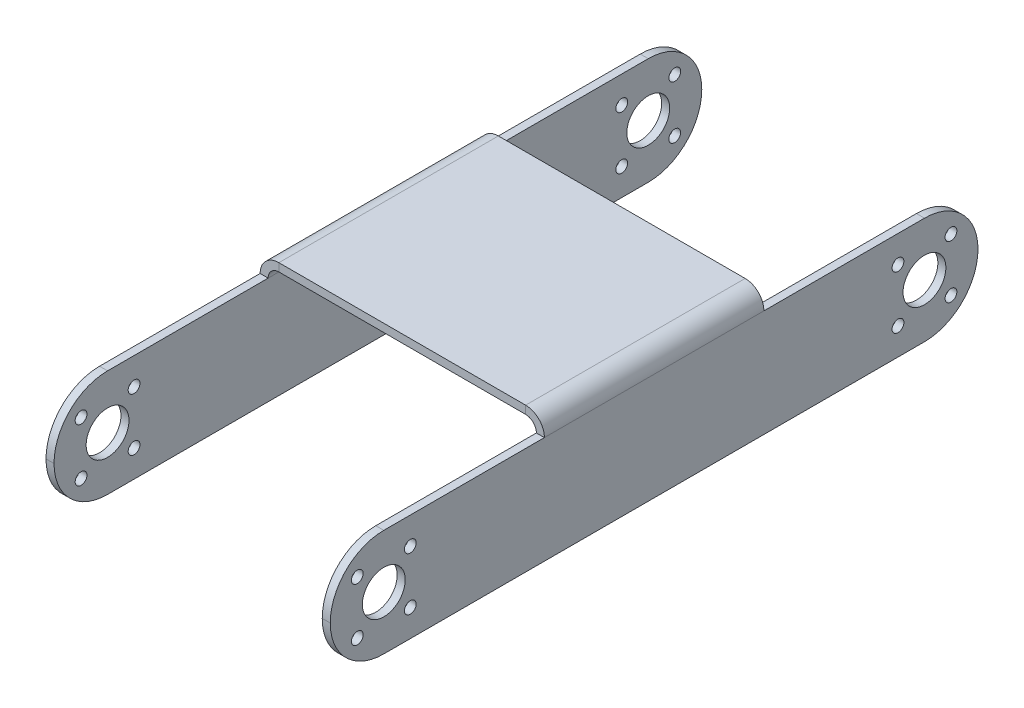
ISO-10303-21;
HEADER;
FILE_DESCRIPTION(('STEP AP214'),'2;1');
FILE_NAME('part.step','',(''),(''),'','','');
FILE_SCHEMA(('AUTOMOTIVE_DESIGN { 1 0 10303 214 1 1 1 1 }'));
ENDSEC;
DATA;
#1=APPLICATION_CONTEXT('core data for automotive mechanical design processes');
#2=APPLICATION_PROTOCOL_DEFINITION('international standard','automotive_design',2000,#1);
#3=PRODUCT_CONTEXT('',#1,'mechanical');
#4=PRODUCT('Part','Part','',(#3));
#5=PRODUCT_RELATED_PRODUCT_CATEGORY('part','',(#4));
#6=PRODUCT_DEFINITION_FORMATION('','',#4);
#7=PRODUCT_DEFINITION_CONTEXT('part definition',#1,'design');
#8=PRODUCT_DEFINITION('design','',#6,#7);
#9=PRODUCT_DEFINITION_SHAPE('','',#8);
#10=(LENGTH_UNIT() NAMED_UNIT(*) SI_UNIT(.MILLI.,.METRE.));
#11=(NAMED_UNIT(*) PLANE_ANGLE_UNIT() SI_UNIT($,.RADIAN.));
#12=(NAMED_UNIT(*) SI_UNIT($,.STERADIAN.) SOLID_ANGLE_UNIT());
#13=UNCERTAINTY_MEASURE_WITH_UNIT(LENGTH_MEASURE(1.E-05),#10,'distance_accuracy_value','');
#14=(GEOMETRIC_REPRESENTATION_CONTEXT(3) GLOBAL_UNCERTAINTY_ASSIGNED_CONTEXT((#13)) GLOBAL_UNIT_ASSIGNED_CONTEXT((#10,
#11,#12)) REPRESENTATION_CONTEXT('',''));
#15=CARTESIAN_POINT('',(0.,0.,0.));
#16=DIRECTION('',(0.,0.,1.));
#17=DIRECTION('',(1.,0.,0.));
#18=AXIS2_PLACEMENT_3D('',#15,#16,#17);
#19=CARTESIAN_POINT('',(-1.5,9.99999999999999,-60.5));
#20=DIRECTION('',(0.,1.,0.));
#21=DIRECTION('',(0.,0.,1.));
#22=AXIS2_PLACEMENT_3D('',#19,#20,#21);
#23=PLANE('',#22);
#24=DIRECTION('',(0.,0.,1.));
#25=VECTOR('',#24,1.);
#26=CARTESIAN_POINT('',(-1.5,9.99999999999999,-60.5));
#27=LINE('',#26,#25);
#28=CARTESIAN_POINT('',(-1.5,9.99999999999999,-50.5));
#29=VERTEX_POINT('',#28);
#30=CARTESIAN_POINT('',(-1.5,9.99999999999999,-20.5));
#31=VERTEX_POINT('',#30);
#32=EDGE_CURVE('E554',#29,#31,#27,.T.);
#33=ORIENTED_EDGE('',*,*,#32,.T.);
#34=DIRECTION('',(1.,0.,0.));
#35=VECTOR('',#34,1.);
#36=CARTESIAN_POINT('',(-1.5,9.99999999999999,-20.5));
#37=LINE('',#36,#35);
#38=CARTESIAN_POINT('',(0.,9.99999999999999,-20.5));
#39=VERTEX_POINT('',#38);
#40=EDGE_CURVE('E447',#31,#39,#37,.T.);
#41=ORIENTED_EDGE('',*,*,#40,.T.);
#42=DIRECTION('',(0.,0.,1.));
#43=VECTOR('',#42,1.);
#44=CARTESIAN_POINT('',(0.,9.99999999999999,-60.5));
#45=LINE('',#44,#43);
#46=CARTESIAN_POINT('',(0.,9.99999999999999,-50.5));
#47=VERTEX_POINT('',#46);
#48=EDGE_CURVE('E553',#47,#39,#45,.T.);
#49=ORIENTED_EDGE('',*,*,#48,.F.);
#50=DIRECTION('',(1.,0.,0.));
#51=VECTOR('',#50,1.);
#52=CARTESIAN_POINT('',(-1.5,9.99999999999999,-50.5));
#53=LINE('',#52,#51);
#54=EDGE_CURVE('E13',#47,#29,#53,.F.);
#55=ORIENTED_EDGE('',*,*,#54,.T.);
#56=EDGE_LOOP('',(#33,#41,#49,#55));
#57=FACE_BOUND('',#56,.T.);
#58=ADVANCED_FACE('F67',(#57),#23,.T.);
#59=DIRECTION('',(1.,0.,0.));
#60=VECTOR('',#59,1.);
#61=CARTESIAN_POINT('',(-1.5,9.99999999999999,20.5));
#62=LINE('',#61,#60);
#63=CARTESIAN_POINT('',(-1.5,9.99999999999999,20.5));
#64=VERTEX_POINT('',#63);
#65=CARTESIAN_POINT('',(0.,9.99999999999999,20.5));
#66=VERTEX_POINT('',#65);
#67=EDGE_CURVE('E460',#64,#66,#62,.T.);
#68=ORIENTED_EDGE('',*,*,#67,.F.);
#69=CARTESIAN_POINT('',(-1.5,9.99999999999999,50.5));
#70=VERTEX_POINT('',#69);
#71=EDGE_CURVE('E552',#64,#70,#27,.T.);
#72=ORIENTED_EDGE('',*,*,#71,.T.);
#73=DIRECTION('',(1.,0.,0.));
#74=VECTOR('',#73,1.);
#75=CARTESIAN_POINT('',(-1.5,9.99999999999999,50.5));
#76=LINE('',#75,#74);
#77=CARTESIAN_POINT('',(0.,9.99999999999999,50.5));
#78=VERTEX_POINT('',#77);
#79=EDGE_CURVE('E77',#70,#78,#76,.T.);
#80=ORIENTED_EDGE('',*,*,#79,.T.);
#81=EDGE_CURVE('E562',#66,#78,#45,.T.);
#82=ORIENTED_EDGE('',*,*,#81,.F.);
#83=EDGE_LOOP('',(#68,#72,#80,#82));
#84=FACE_BOUND('',#83,.T.);
#85=ADVANCED_FACE('F642',(#84),#23,.T.);
#86=CARTESIAN_POINT('',(-1.5,-9.99999999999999,-60.5));
#87=DIRECTION('',(0.,-1.,0.));
#88=DIRECTION('',(0.,0.,-1.));
#89=AXIS2_PLACEMENT_3D('',#86,#87,#88);
#90=PLANE('',#89);
#91=DIRECTION('',(0.,0.,-1.));
#92=VECTOR('',#91,1.);
#93=CARTESIAN_POINT('',(-1.5,-9.99999999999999,-60.5));
#94=LINE('',#93,#92);
#95=CARTESIAN_POINT('',(-1.5,-9.99999999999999,50.5));
#96=VERTEX_POINT('',#95);
#97=CARTESIAN_POINT('',(-1.5,-9.99999999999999,-50.5));
#98=VERTEX_POINT('',#97);
#99=EDGE_CURVE('E548',#96,#98,#94,.T.);
#100=ORIENTED_EDGE('',*,*,#99,.T.);
#101=DIRECTION('',(1.,0.,0.));
#102=VECTOR('',#101,1.);
#103=CARTESIAN_POINT('',(-1.5,-9.99999999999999,-50.5));
#104=LINE('',#103,#102);
#105=CARTESIAN_POINT('',(0.,-9.99999999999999,-50.5));
#106=VERTEX_POINT('',#105);
#107=EDGE_CURVE('E569',#98,#106,#104,.T.);
#108=ORIENTED_EDGE('',*,*,#107,.T.);
#109=DIRECTION('',(0.,0.,-1.));
#110=VECTOR('',#109,1.);
#111=CARTESIAN_POINT('',(0.,-9.99999999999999,-60.5));
#112=LINE('',#111,#110);
#113=CARTESIAN_POINT('',(0.,-9.99999999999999,50.5));
#114=VERTEX_POINT('',#113);
#115=EDGE_CURVE('E544',#114,#106,#112,.T.);
#116=ORIENTED_EDGE('',*,*,#115,.F.);
#117=DIRECTION('',(1.,0.,0.));
#118=VECTOR('',#117,1.);
#119=CARTESIAN_POINT('',(-1.5,-9.99999999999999,50.5));
#120=LINE('',#119,#118);
#121=EDGE_CURVE('E558',#114,#96,#120,.F.);
#122=ORIENTED_EDGE('',*,*,#121,.T.);
#123=EDGE_LOOP('',(#100,#108,#116,#122));
#124=FACE_BOUND('',#123,.T.);
#125=ADVANCED_FACE('F620',(#124),#90,.T.);
#126=CARTESIAN_POINT('',(-1.5,0.,0.));
#127=DIRECTION('',(1.,0.,0.));
#128=DIRECTION('',(0.,0.,-1.));
#129=AXIS2_PLACEMENT_3D('',#126,#127,#128);
#130=PLANE('',#129);
#131=CARTESIAN_POINT('',(-1.5,-4.94974746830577,-55.4497474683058));
#132=DIRECTION('',(1.,0.,0.));
#133=DIRECTION('',(0.,0.,1.));
#134=AXIS2_PLACEMENT_3D('',#131,#132,#133);
#135=CIRCLE('',#134,1.1);
#136=CARTESIAN_POINT('',(-1.5,-4.94974746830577,-54.3497474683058));
#137=VERTEX_POINT('',#136);
#138=EDGE_CURVE('E470',#137,#137,#135,.T.);
#139=ORIENTED_EDGE('',*,*,#138,.T.);
#140=EDGE_LOOP('',(#139));
#141=FACE_BOUND('',#140,.T.);
#142=CARTESIAN_POINT('',(-1.5,-4.94974746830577,55.4497474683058));
#143=DIRECTION('',(1.,0.,0.));
#144=DIRECTION('',(0.,0.,-1.));
#145=AXIS2_PLACEMENT_3D('',#142,#143,#144);
#146=CIRCLE('',#145,1.1);
#147=CARTESIAN_POINT('',(-1.5,-4.94974746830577,54.3497474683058));
#148=VERTEX_POINT('',#147);
#149=EDGE_CURVE('E497',#148,#148,#146,.T.);
#150=ORIENTED_EDGE('',*,*,#149,.T.);
#151=EDGE_LOOP('',(#150));
#152=FACE_BOUND('',#151,.T.);
#153=CARTESIAN_POINT('',(-1.5,-4.94974746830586,45.5502525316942));
#154=DIRECTION('',(1.,0.,0.));
#155=DIRECTION('',(0.,0.,-1.));
#156=AXIS2_PLACEMENT_3D('',#153,#154,#155);
#157=CIRCLE('',#156,1.09999999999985);
#158=CARTESIAN_POINT('',(-1.5,-4.94974746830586,44.4502525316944));
#159=VERTEX_POINT('',#158);
#160=EDGE_CURVE('E496',#159,#159,#157,.T.);
#161=ORIENTED_EDGE('',*,*,#160,.T.);
#162=EDGE_LOOP('',(#161));
#163=FACE_BOUND('',#162,.T.);
#164=CARTESIAN_POINT('',(-1.5,4.94974746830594,45.5502525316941));
#165=DIRECTION('',(1.,0.,0.));
#166=DIRECTION('',(0.,0.,-1.));
#167=AXIS2_PLACEMENT_3D('',#164,#165,#166);
#168=CIRCLE('',#167,1.1);
#169=CARTESIAN_POINT('',(-1.5,4.94974746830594,44.4502525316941));
#170=VERTEX_POINT('',#169);
#171=EDGE_CURVE('E513',#170,#170,#168,.T.);
#172=ORIENTED_EDGE('',*,*,#171,.T.);
#173=EDGE_LOOP('',(#172));
#174=FACE_BOUND('',#173,.T.);
#175=CARTESIAN_POINT('',(-1.5,-4.94974746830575,-45.5502525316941));
#176=DIRECTION('',(1.,0.,0.));
#177=DIRECTION('',(0.,0.,1.));
#178=AXIS2_PLACEMENT_3D('',#175,#176,#177);
#179=CIRCLE('',#178,1.1);
#180=CARTESIAN_POINT('',(-1.5,-4.94974746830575,-44.4502525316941));
#181=VERTEX_POINT('',#180);
#182=EDGE_CURVE('E471',#181,#181,#179,.T.);
#183=ORIENTED_EDGE('',*,*,#182,.T.);
#184=EDGE_LOOP('',(#183));
#185=FACE_BOUND('',#184,.T.);
#186=CARTESIAN_POINT('',(-1.5,4.94974746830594,-45.5502525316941));
#187=DIRECTION('',(1.,0.,0.));
#188=DIRECTION('',(0.,0.,1.));
#189=AXIS2_PLACEMENT_3D('',#186,#187,#188);
#190=CIRCLE('',#189,1.1);
#191=CARTESIAN_POINT('',(-1.5,4.94974746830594,-44.4502525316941));
#192=VERTEX_POINT('',#191);
#193=EDGE_CURVE('E479',#192,#192,#190,.T.);
#194=ORIENTED_EDGE('',*,*,#193,.T.);
#195=EDGE_LOOP('',(#194));
#196=FACE_BOUND('',#195,.T.);
#197=CARTESIAN_POINT('',(-1.5,4.94974746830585,-55.4497474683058));
#198=DIRECTION('',(1.,0.,0.));
#199=DIRECTION('',(0.,0.,1.));
#200=AXIS2_PLACEMENT_3D('',#197,#198,#199);
#201=CIRCLE('',#200,1.1);
#202=CARTESIAN_POINT('',(-1.5,4.94974746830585,-54.3497474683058));
#203=VERTEX_POINT('',#202);
#204=EDGE_CURVE('E487',#203,#203,#201,.T.);
#205=ORIENTED_EDGE('',*,*,#204,.T.);
#206=EDGE_LOOP('',(#205));
#207=FACE_BOUND('',#206,.T.);
#208=CARTESIAN_POINT('',(-1.5,4.94974746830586,55.4497474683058));
#209=DIRECTION('',(1.,0.,0.));
#210=DIRECTION('',(0.,0.,-1.));
#211=AXIS2_PLACEMENT_3D('',#208,#209,#210);
#212=CIRCLE('',#211,1.09999999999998);
#213=CARTESIAN_POINT('',(-1.5,4.94974746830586,54.3497474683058));
#214=VERTEX_POINT('',#213);
#215=EDGE_CURVE('E524',#214,#214,#212,.T.);
#216=ORIENTED_EDGE('',*,*,#215,.T.);
#217=EDGE_LOOP('',(#216));
#218=FACE_BOUND('',#217,.T.);
#219=CARTESIAN_POINT('',(-1.5,0.,-50.5));
#220=DIRECTION('',(1.,0.,0.));
#221=DIRECTION('',(0.,0.,1.));
#222=AXIS2_PLACEMENT_3D('',#219,#220,#221);
#223=CIRCLE('',#222,4.00000000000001);
#224=CARTESIAN_POINT('',(-1.5,0.,-46.5));
#225=VERTEX_POINT('',#224);
#226=EDGE_CURVE('E532',#225,#225,#223,.T.);
#227=ORIENTED_EDGE('',*,*,#226,.T.);
#228=EDGE_LOOP('',(#227));
#229=FACE_BOUND('',#228,.T.);
#230=CARTESIAN_POINT('',(-1.5,0.,50.5));
#231=DIRECTION('',(1.,0.,0.));
#232=DIRECTION('',(0.,0.,-1.));
#233=AXIS2_PLACEMENT_3D('',#230,#231,#232);
#234=CIRCLE('',#233,4.00000000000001);
#235=CARTESIAN_POINT('',(-1.5,0.,46.5));
#236=VERTEX_POINT('',#235);
#237=EDGE_CURVE('E540',#236,#236,#234,.T.);
#238=ORIENTED_EDGE('',*,*,#237,.T.);
#239=EDGE_LOOP('',(#238));
#240=FACE_BOUND('',#239,.T.);
#241=CARTESIAN_POINT('',(-1.5,0.,-50.5));
#242=DIRECTION('',(1.,0.,0.));
#243=DIRECTION('',(0.,0.,-1.));
#244=AXIS2_PLACEMENT_3D('',#241,#242,#243);
#245=CIRCLE('',#244,10.);
#246=CARTESIAN_POINT('',(-1.5,0.,-60.5));
#247=VERTEX_POINT('',#246);
#248=EDGE_CURVE('E93',#29,#247,#245,.F.);
#249=ORIENTED_EDGE('',*,*,#248,.T.);
#250=CARTESIAN_POINT('',(-1.5,0.,-50.5));
#251=DIRECTION('',(1.,0.,0.));
#252=DIRECTION('',(0.,0.,-1.));
#253=AXIS2_PLACEMENT_3D('',#250,#251,#252);
#254=CIRCLE('',#253,10.);
#255=EDGE_CURVE('E594',#247,#98,#254,.F.);
#256=ORIENTED_EDGE('',*,*,#255,.T.);
#257=ORIENTED_EDGE('',*,*,#99,.F.);
#258=CARTESIAN_POINT('',(-1.5,0.,50.5));
#259=DIRECTION('',(1.,0.,0.));
#260=DIRECTION('',(0.,0.,-1.));
#261=AXIS2_PLACEMENT_3D('',#258,#259,#260);
#262=CIRCLE('',#261,10.);
#263=CARTESIAN_POINT('',(-1.5,0.,60.5));
#264=VERTEX_POINT('',#263);
#265=EDGE_CURVE('E589',#96,#264,#262,.F.);
#266=ORIENTED_EDGE('',*,*,#265,.T.);
#267=CARTESIAN_POINT('',(-1.5,0.,50.5));
#268=DIRECTION('',(1.,0.,0.));
#269=DIRECTION('',(0.,0.,-1.));
#270=AXIS2_PLACEMENT_3D('',#267,#268,#269);
#271=CIRCLE('',#270,10.);
#272=EDGE_CURVE('E585',#264,#70,#271,.F.);
#273=ORIENTED_EDGE('',*,*,#272,.T.);
#274=ORIENTED_EDGE('',*,*,#71,.F.);
#275=DIRECTION('',(0.,0.,-1.));
#276=VECTOR('',#275,1.);
#277=CARTESIAN_POINT('',(-1.5,9.99999999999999,-20.5));
#278=LINE('',#277,#276);
#279=EDGE_CURVE('E454',#31,#64,#278,.F.);
#280=ORIENTED_EDGE('',*,*,#279,.F.);
#281=ORIENTED_EDGE('',*,*,#32,.F.);
#282=EDGE_LOOP('',(#249,#256,#257,#266,#273,#274,#280,#281));
#283=FACE_BOUND('',#282,.T.);
#284=ADVANCED_FACE('F615',(#141,#152,#163,#174,#185,#196,#207,#218,#229,#240,#283),#130,.F.);
#285=CARTESIAN_POINT('',(0.,0.,0.));
#286=DIRECTION('',(1.,0.,0.));
#287=DIRECTION('',(0.,0.,-1.));
#288=AXIS2_PLACEMENT_3D('',#285,#286,#287);
#289=PLANE('',#288);
#290=CARTESIAN_POINT('',(0.,-4.94974746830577,-55.4497474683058));
#291=DIRECTION('',(1.,0.,0.));
#292=DIRECTION('',(0.,0.,1.));
#293=AXIS2_PLACEMENT_3D('',#290,#291,#292);
#294=CIRCLE('',#293,1.1);
#295=CARTESIAN_POINT('',(0.,-4.94974746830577,-54.3497474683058));
#296=VERTEX_POINT('',#295);
#297=EDGE_CURVE('E501',#296,#296,#294,.T.);
#298=ORIENTED_EDGE('',*,*,#297,.F.);
#299=EDGE_LOOP('',(#298));
#300=FACE_BOUND('',#299,.T.);
#301=CARTESIAN_POINT('',(0.,-4.94974746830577,55.4497474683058));
#302=DIRECTION('',(1.,0.,0.));
#303=DIRECTION('',(0.,0.,-1.));
#304=AXIS2_PLACEMENT_3D('',#301,#302,#303);
#305=CIRCLE('',#304,1.1);
#306=CARTESIAN_POINT('',(0.,-4.94974746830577,54.3497474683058));
#307=VERTEX_POINT('',#306);
#308=EDGE_CURVE('E492',#307,#307,#305,.T.);
#309=ORIENTED_EDGE('',*,*,#308,.F.);
#310=EDGE_LOOP('',(#309));
#311=FACE_BOUND('',#310,.T.);
#312=CARTESIAN_POINT('',(0.,-4.94974746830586,45.5502525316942));
#313=DIRECTION('',(1.,0.,0.));
#314=DIRECTION('',(0.,0.,-1.));
#315=AXIS2_PLACEMENT_3D('',#312,#313,#314);
#316=CIRCLE('',#315,1.09999999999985);
#317=CARTESIAN_POINT('',(0.,-4.94974746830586,44.4502525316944));
#318=VERTEX_POINT('',#317);
#319=EDGE_CURVE('E517',#318,#318,#316,.T.);
#320=ORIENTED_EDGE('',*,*,#319,.F.);
#321=EDGE_LOOP('',(#320));
#322=FACE_BOUND('',#321,.T.);
#323=CARTESIAN_POINT('',(0.,4.94974746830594,45.5502525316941));
#324=DIRECTION('',(1.,0.,0.));
#325=DIRECTION('',(0.,0.,-1.));
#326=AXIS2_PLACEMENT_3D('',#323,#324,#325);
#327=CIRCLE('',#326,1.1);
#328=CARTESIAN_POINT('',(0.,4.94974746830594,44.4502525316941));
#329=VERTEX_POINT('',#328);
#330=EDGE_CURVE('E508',#329,#329,#327,.T.);
#331=ORIENTED_EDGE('',*,*,#330,.F.);
#332=EDGE_LOOP('',(#331));
#333=FACE_BOUND('',#332,.T.);
#334=CARTESIAN_POINT('',(0.,-4.94974746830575,-45.5502525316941));
#335=DIRECTION('',(1.,0.,0.));
#336=DIRECTION('',(0.,0.,1.));
#337=AXIS2_PLACEMENT_3D('',#334,#335,#336);
#338=CIRCLE('',#337,1.1);
#339=CARTESIAN_POINT('',(0.,-4.94974746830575,-44.4502525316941));
#340=VERTEX_POINT('',#339);
#341=EDGE_CURVE('E466',#340,#340,#338,.T.);
#342=ORIENTED_EDGE('',*,*,#341,.F.);
#343=EDGE_LOOP('',(#342));
#344=FACE_BOUND('',#343,.T.);
#345=CARTESIAN_POINT('',(0.,4.94974746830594,-45.5502525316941));
#346=DIRECTION('',(1.,0.,0.));
#347=DIRECTION('',(0.,0.,1.));
#348=AXIS2_PLACEMENT_3D('',#345,#346,#347);
#349=CIRCLE('',#348,1.1);
#350=CARTESIAN_POINT('',(0.,4.94974746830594,-44.4502525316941));
#351=VERTEX_POINT('',#350);
#352=EDGE_CURVE('E475',#351,#351,#349,.T.);
#353=ORIENTED_EDGE('',*,*,#352,.F.);
#354=EDGE_LOOP('',(#353));
#355=FACE_BOUND('',#354,.T.);
#356=CARTESIAN_POINT('',(0.,4.94974746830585,-55.4497474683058));
#357=DIRECTION('',(1.,0.,0.));
#358=DIRECTION('',(0.,0.,1.));
#359=AXIS2_PLACEMENT_3D('',#356,#357,#358);
#360=CIRCLE('',#359,1.1);
#361=CARTESIAN_POINT('',(0.,4.94974746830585,-54.3497474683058));
#362=VERTEX_POINT('',#361);
#363=EDGE_CURVE('E483',#362,#362,#360,.T.);
#364=ORIENTED_EDGE('',*,*,#363,.F.);
#365=EDGE_LOOP('',(#364));
#366=FACE_BOUND('',#365,.T.);
#367=CARTESIAN_POINT('',(0.,4.94974746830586,55.4497474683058));
#368=DIRECTION('',(1.,0.,0.));
#369=DIRECTION('',(0.,0.,-1.));
#370=AXIS2_PLACEMENT_3D('',#367,#368,#369);
#371=CIRCLE('',#370,1.09999999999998);
#372=CARTESIAN_POINT('',(0.,4.94974746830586,54.3497474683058));
#373=VERTEX_POINT('',#372);
#374=EDGE_CURVE('E512',#373,#373,#371,.T.);
#375=ORIENTED_EDGE('',*,*,#374,.F.);
#376=EDGE_LOOP('',(#375));
#377=FACE_BOUND('',#376,.T.);
#378=CARTESIAN_POINT('',(0.,0.,-50.5));
#379=DIRECTION('',(1.,0.,0.));
#380=DIRECTION('',(0.,0.,1.));
#381=AXIS2_PLACEMENT_3D('',#378,#379,#380);
#382=CIRCLE('',#381,4.00000000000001);
#383=CARTESIAN_POINT('',(0.,0.,-46.5));
#384=VERTEX_POINT('',#383);
#385=EDGE_CURVE('E528',#384,#384,#382,.T.);
#386=ORIENTED_EDGE('',*,*,#385,.F.);
#387=EDGE_LOOP('',(#386));
#388=FACE_BOUND('',#387,.T.);
#389=CARTESIAN_POINT('',(0.,0.,50.5));
#390=DIRECTION('',(1.,0.,0.));
#391=DIRECTION('',(0.,0.,-1.));
#392=AXIS2_PLACEMENT_3D('',#389,#390,#391);
#393=CIRCLE('',#392,4.00000000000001);
#394=CARTESIAN_POINT('',(0.,0.,46.5));
#395=VERTEX_POINT('',#394);
#396=EDGE_CURVE('E536',#395,#395,#393,.T.);
#397=ORIENTED_EDGE('',*,*,#396,.F.);
#398=EDGE_LOOP('',(#397));
#399=FACE_BOUND('',#398,.T.);
#400=ORIENTED_EDGE('',*,*,#115,.T.);
#401=CARTESIAN_POINT('',(0.,0.,-50.5));
#402=DIRECTION('',(1.,0.,0.));
#403=DIRECTION('',(0.,0.,-1.));
#404=AXIS2_PLACEMENT_3D('',#401,#402,#403);
#405=CIRCLE('',#404,10.);
#406=CARTESIAN_POINT('',(0.,0.,-60.5));
#407=VERTEX_POINT('',#406);
#408=EDGE_CURVE('E582',#106,#407,#405,.T.);
#409=ORIENTED_EDGE('',*,*,#408,.T.);
#410=CARTESIAN_POINT('',(0.,0.,-50.5));
#411=DIRECTION('',(1.,0.,0.));
#412=DIRECTION('',(0.,0.,-1.));
#413=AXIS2_PLACEMENT_3D('',#410,#411,#412);
#414=CIRCLE('',#413,10.);
#415=EDGE_CURVE('E579',#407,#47,#414,.T.);
#416=ORIENTED_EDGE('',*,*,#415,.T.);
#417=ORIENTED_EDGE('',*,*,#48,.T.);
#418=DIRECTION('',(0.,0.,-1.));
#419=VECTOR('',#418,1.);
#420=CARTESIAN_POINT('',(0.,9.99999999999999,-20.5));
#421=LINE('',#420,#419);
#422=EDGE_CURVE('E439',#39,#66,#421,.F.);
#423=ORIENTED_EDGE('',*,*,#422,.T.);
#424=ORIENTED_EDGE('',*,*,#81,.T.);
#425=CARTESIAN_POINT('',(0.,0.,50.5));
#426=DIRECTION('',(1.,0.,0.));
#427=DIRECTION('',(0.,0.,-1.));
#428=AXIS2_PLACEMENT_3D('',#425,#426,#427);
#429=CIRCLE('',#428,10.);
#430=CARTESIAN_POINT('',(0.,0.,60.5));
#431=VERTEX_POINT('',#430);
#432=EDGE_CURVE('E573',#78,#431,#429,.T.);
#433=ORIENTED_EDGE('',*,*,#432,.T.);
#434=CARTESIAN_POINT('',(0.,0.,50.5));
#435=DIRECTION('',(1.,0.,0.));
#436=DIRECTION('',(0.,0.,-1.));
#437=AXIS2_PLACEMENT_3D('',#434,#435,#436);
#438=CIRCLE('',#437,10.);
#439=EDGE_CURVE('E576',#431,#114,#438,.T.);
#440=ORIENTED_EDGE('',*,*,#439,.T.);
#441=EDGE_LOOP('',(#400,#409,#416,#417,#423,#424,#433,#440));
#442=FACE_BOUND('',#441,.T.);
#443=ADVANCED_FACE('F625',(#300,#311,#322,#333,#344,#355,#366,#377,#388,#399,#442),#289,.T.);
#444=CARTESIAN_POINT('',(-1.5,0.,50.5));
#445=DIRECTION('',(1.,0.,0.));
#446=DIRECTION('',(0.,0.,-1.));
#447=AXIS2_PLACEMENT_3D('',#444,#445,#446);
#448=CYLINDRICAL_SURFACE('',#447,4.00000000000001);
#449=ORIENTED_EDGE('',*,*,#237,.F.);
#450=EDGE_LOOP('',(#449));
#451=FACE_BOUND('',#450,.T.);
#452=ORIENTED_EDGE('',*,*,#396,.T.);
#453=EDGE_LOOP('',(#452));
#454=FACE_BOUND('',#453,.T.);
#455=ADVANCED_FACE('F796',(#451,#454),#448,.F.);
#456=CARTESIAN_POINT('',(-1.5,0.,-50.5));
#457=DIRECTION('',(1.,0.,0.));
#458=DIRECTION('',(0.,0.,-1.));
#459=AXIS2_PLACEMENT_3D('',#456,#457,#458);
#460=CYLINDRICAL_SURFACE('',#459,4.00000000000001);
#461=ORIENTED_EDGE('',*,*,#226,.F.);
#462=EDGE_LOOP('',(#461));
#463=FACE_BOUND('',#462,.T.);
#464=ORIENTED_EDGE('',*,*,#385,.T.);
#465=EDGE_LOOP('',(#464));
#466=FACE_BOUND('',#465,.T.);
#467=ADVANCED_FACE('F785',(#463,#466),#460,.F.);
#468=CARTESIAN_POINT('',(-1.5,4.94974746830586,55.4497474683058));
#469=DIRECTION('',(1.,0.,0.));
#470=DIRECTION('',(0.,0.,-1.));
#471=AXIS2_PLACEMENT_3D('',#468,#469,#470);
#472=CYLINDRICAL_SURFACE('',#471,1.09999999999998);
#473=ORIENTED_EDGE('',*,*,#215,.F.);
#474=EDGE_LOOP('',(#473));
#475=FACE_BOUND('',#474,.T.);
#476=ORIENTED_EDGE('',*,*,#374,.T.);
#477=EDGE_LOOP('',(#476));
#478=FACE_BOUND('',#477,.T.);
#479=ADVANCED_FACE('F774',(#475,#478),#472,.F.);
#480=CARTESIAN_POINT('',(-1.5,4.94974746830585,-55.4497474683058));
#481=DIRECTION('',(1.,0.,0.));
#482=DIRECTION('',(0.,0.,-1.));
#483=AXIS2_PLACEMENT_3D('',#480,#481,#482);
#484=CYLINDRICAL_SURFACE('',#483,1.1);
#485=ORIENTED_EDGE('',*,*,#204,.F.);
#486=EDGE_LOOP('',(#485));
#487=FACE_BOUND('',#486,.T.);
#488=ORIENTED_EDGE('',*,*,#363,.T.);
#489=EDGE_LOOP('',(#488));
#490=FACE_BOUND('',#489,.T.);
#491=ADVANCED_FACE('F763',(#487,#490),#484,.F.);
#492=CARTESIAN_POINT('',(-1.5,4.94974746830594,-45.5502525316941));
#493=DIRECTION('',(1.,0.,0.));
#494=DIRECTION('',(0.,0.,-1.));
#495=AXIS2_PLACEMENT_3D('',#492,#493,#494);
#496=CYLINDRICAL_SURFACE('',#495,1.1);
#497=ORIENTED_EDGE('',*,*,#193,.F.);
#498=EDGE_LOOP('',(#497));
#499=FACE_BOUND('',#498,.T.);
#500=ORIENTED_EDGE('',*,*,#352,.T.);
#501=EDGE_LOOP('',(#500));
#502=FACE_BOUND('',#501,.T.);
#503=ADVANCED_FACE('F752',(#499,#502),#496,.F.);
#504=CARTESIAN_POINT('',(-1.5,-4.94974746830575,-45.5502525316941));
#505=DIRECTION('',(1.,0.,0.));
#506=DIRECTION('',(0.,0.,-1.));
#507=AXIS2_PLACEMENT_3D('',#504,#505,#506);
#508=CYLINDRICAL_SURFACE('',#507,1.1);
#509=ORIENTED_EDGE('',*,*,#182,.F.);
#510=EDGE_LOOP('',(#509));
#511=FACE_BOUND('',#510,.T.);
#512=ORIENTED_EDGE('',*,*,#341,.T.);
#513=EDGE_LOOP('',(#512));
#514=FACE_BOUND('',#513,.T.);
#515=ADVANCED_FACE('F741',(#511,#514),#508,.F.);
#516=CARTESIAN_POINT('',(-1.5,4.94974746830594,45.5502525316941));
#517=DIRECTION('',(1.,0.,0.));
#518=DIRECTION('',(0.,0.,-1.));
#519=AXIS2_PLACEMENT_3D('',#516,#517,#518);
#520=CYLINDRICAL_SURFACE('',#519,1.1);
#521=ORIENTED_EDGE('',*,*,#171,.F.);
#522=EDGE_LOOP('',(#521));
#523=FACE_BOUND('',#522,.T.);
#524=ORIENTED_EDGE('',*,*,#330,.T.);
#525=EDGE_LOOP('',(#524));
#526=FACE_BOUND('',#525,.T.);
#527=ADVANCED_FACE('F730',(#523,#526),#520,.F.);
#528=CARTESIAN_POINT('',(-1.5,-4.94974746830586,45.5502525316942));
#529=DIRECTION('',(1.,0.,0.));
#530=DIRECTION('',(0.,0.,-1.));
#531=AXIS2_PLACEMENT_3D('',#528,#529,#530);
#532=CYLINDRICAL_SURFACE('',#531,1.09999999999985);
#533=ORIENTED_EDGE('',*,*,#160,.F.);
#534=EDGE_LOOP('',(#533));
#535=FACE_BOUND('',#534,.T.);
#536=ORIENTED_EDGE('',*,*,#319,.T.);
#537=EDGE_LOOP('',(#536));
#538=FACE_BOUND('',#537,.T.);
#539=ADVANCED_FACE('F719',(#535,#538),#532,.F.);
#540=CARTESIAN_POINT('',(-1.5,-4.94974746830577,55.4497474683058));
#541=DIRECTION('',(1.,0.,0.));
#542=DIRECTION('',(0.,0.,-1.));
#543=AXIS2_PLACEMENT_3D('',#540,#541,#542);
#544=CYLINDRICAL_SURFACE('',#543,1.1);
#545=ORIENTED_EDGE('',*,*,#149,.F.);
#546=EDGE_LOOP('',(#545));
#547=FACE_BOUND('',#546,.T.);
#548=ORIENTED_EDGE('',*,*,#308,.T.);
#549=EDGE_LOOP('',(#548));
#550=FACE_BOUND('',#549,.T.);
#551=ADVANCED_FACE('F708',(#547,#550),#544,.F.);
#552=CARTESIAN_POINT('',(-1.5,-4.94974746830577,-55.4497474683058));
#553=DIRECTION('',(1.,0.,0.));
#554=DIRECTION('',(0.,0.,-1.));
#555=AXIS2_PLACEMENT_3D('',#552,#553,#554);
#556=CYLINDRICAL_SURFACE('',#555,1.1);
#557=ORIENTED_EDGE('',*,*,#138,.F.);
#558=EDGE_LOOP('',(#557));
#559=FACE_BOUND('',#558,.T.);
#560=ORIENTED_EDGE('',*,*,#297,.T.);
#561=EDGE_LOOP('',(#560));
#562=FACE_BOUND('',#561,.T.);
#563=ADVANCED_FACE('F687',(#559,#562),#556,.F.);
#564=CARTESIAN_POINT('',(-1.5,0.,-50.5));
#565=DIRECTION('',(1.,0.,0.));
#566=DIRECTION('',(0.,0.,-1.));
#567=AXIS2_PLACEMENT_3D('',#564,#565,#566);
#568=CYLINDRICAL_SURFACE('',#567,10.);
#569=DIRECTION('',(1.,0.,0.));
#570=VECTOR('',#569,1.);
#571=CARTESIAN_POINT('',(-1.5,0.,-60.5));
#572=LINE('',#571,#570);
#573=EDGE_CURVE('E491',#247,#407,#572,.T.);
#574=ORIENTED_EDGE('',*,*,#573,.F.);
#575=ORIENTED_EDGE('',*,*,#248,.F.);
#576=ORIENTED_EDGE('',*,*,#54,.F.);
#577=ORIENTED_EDGE('',*,*,#415,.F.);
#578=EDGE_LOOP('',(#574,#575,#576,#577));
#579=FACE_BOUND('',#578,.T.);
#580=ADVANCED_FACE('F629',(#579),#568,.T.);
#581=CARTESIAN_POINT('',(-1.5,0.,-50.5));
#582=DIRECTION('',(1.,0.,0.));
#583=DIRECTION('',(0.,0.,-1.));
#584=AXIS2_PLACEMENT_3D('',#581,#582,#583);
#585=CYLINDRICAL_SURFACE('',#584,10.);
#586=ORIENTED_EDGE('',*,*,#255,.F.);
#587=ORIENTED_EDGE('',*,*,#573,.T.);
#588=ORIENTED_EDGE('',*,*,#408,.F.);
#589=ORIENTED_EDGE('',*,*,#107,.F.);
#590=EDGE_LOOP('',(#586,#587,#588,#589));
#591=FACE_BOUND('',#590,.T.);
#592=ADVANCED_FACE('F622',(#591),#585,.T.);
#593=CARTESIAN_POINT('',(-1.5,0.,50.5));
#594=DIRECTION('',(1.,0.,0.));
#595=DIRECTION('',(0.,0.,-1.));
#596=AXIS2_PLACEMENT_3D('',#593,#594,#595);
#597=CYLINDRICAL_SURFACE('',#596,10.);
#598=ORIENTED_EDGE('',*,*,#79,.F.);
#599=ORIENTED_EDGE('',*,*,#272,.F.);
#600=DIRECTION('',(1.,0.,0.));
#601=VECTOR('',#600,1.);
#602=CARTESIAN_POINT('',(-1.5,0.,60.5));
#603=LINE('',#602,#601);
#604=EDGE_CURVE('E71',#431,#264,#603,.F.);
#605=ORIENTED_EDGE('',*,*,#604,.F.);
#606=ORIENTED_EDGE('',*,*,#432,.F.);
#607=EDGE_LOOP('',(#598,#599,#605,#606));
#608=FACE_BOUND('',#607,.T.);
#609=ADVANCED_FACE('F69',(#608),#597,.T.);
#610=CARTESIAN_POINT('',(-1.5,0.,50.5));
#611=DIRECTION('',(1.,0.,0.));
#612=DIRECTION('',(0.,0.,-1.));
#613=AXIS2_PLACEMENT_3D('',#610,#611,#612);
#614=CYLINDRICAL_SURFACE('',#613,10.);
#615=ORIENTED_EDGE('',*,*,#265,.F.);
#616=ORIENTED_EDGE('',*,*,#121,.F.);
#617=ORIENTED_EDGE('',*,*,#439,.F.);
#618=ORIENTED_EDGE('',*,*,#604,.T.);
#619=EDGE_LOOP('',(#615,#616,#617,#618));
#620=FACE_BOUND('',#619,.T.);
#621=ADVANCED_FACE('F608',(#620),#614,.T.);
#622=CARTESIAN_POINT('',(-3.5,9.99999999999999,20.5));
#623=DIRECTION('',(0.,0.,1.));
#624=DIRECTION('',(1.,0.,0.));
#625=AXIS2_PLACEMENT_3D('',#622,#623,#624);
#626=PLANE('',#625);
#627=DIRECTION('',(0.,-1.,0.));
#628=VECTOR('',#627,1.);
#629=CARTESIAN_POINT('',(-3.49999999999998,13.5,20.5));
#630=LINE('',#629,#628);
#631=CARTESIAN_POINT('',(-3.49999999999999,12.,20.5));
#632=VERTEX_POINT('',#631);
#633=CARTESIAN_POINT('',(-3.49999999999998,13.5,20.5));
#634=VERTEX_POINT('',#633);
#635=EDGE_CURVE('E415',#632,#634,#630,.F.);
#636=ORIENTED_EDGE('',*,*,#635,.F.);
#637=CARTESIAN_POINT('',(-3.5,9.99999999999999,20.5));
#638=DIRECTION('',(0.,0.,-1.));
#639=DIRECTION('',(-1.,0.,0.));
#640=AXIS2_PLACEMENT_3D('',#637,#638,#639);
#641=CIRCLE('',#640,2.);
#642=EDGE_CURVE('E450',#64,#632,#641,.F.);
#643=ORIENTED_EDGE('',*,*,#642,.F.);
#644=ORIENTED_EDGE('',*,*,#67,.T.);
#645=CARTESIAN_POINT('',(-3.5,9.99999999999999,20.5));
#646=DIRECTION('',(0.,0.,-1.));
#647=DIRECTION('',(-1.,0.,0.));
#648=AXIS2_PLACEMENT_3D('',#645,#646,#647);
#649=CIRCLE('',#648,3.5);
#650=EDGE_CURVE('E443',#66,#634,#649,.F.);
#651=ORIENTED_EDGE('',*,*,#650,.T.);
#652=EDGE_LOOP('',(#636,#643,#644,#651));
#653=FACE_BOUND('',#652,.T.);
#654=ADVANCED_FACE('F638',(#653),#626,.T.);
#655=CARTESIAN_POINT('',(-3.5,9.99999999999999,-20.5));
#656=DIRECTION('',(0.,0.,1.));
#657=DIRECTION('',(1.,0.,0.));
#658=AXIS2_PLACEMENT_3D('',#655,#656,#657);
#659=PLANE('',#658);
#660=CARTESIAN_POINT('',(-3.5,9.99999999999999,-20.5));
#661=DIRECTION('',(0.,0.,-1.));
#662=DIRECTION('',(-1.,0.,0.));
#663=AXIS2_PLACEMENT_3D('',#660,#661,#662);
#664=CIRCLE('',#663,2.);
#665=CARTESIAN_POINT('',(-3.49999999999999,12.,-20.5));
#666=VERTEX_POINT('',#665);
#667=EDGE_CURVE('E421',#666,#31,#664,.T.);
#668=ORIENTED_EDGE('',*,*,#667,.F.);
#669=DIRECTION('',(0.,-1.,0.));
#670=VECTOR('',#669,1.);
#671=CARTESIAN_POINT('',(-3.49999999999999,12.,-20.5));
#672=LINE('',#671,#670);
#673=CARTESIAN_POINT('',(-3.49999999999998,13.5,-20.5));
#674=VERTEX_POINT('',#673);
#675=EDGE_CURVE('E430',#666,#674,#672,.F.);
#676=ORIENTED_EDGE('',*,*,#675,.T.);
#677=CARTESIAN_POINT('',(-3.5,9.99999999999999,-20.5));
#678=DIRECTION('',(0.,0.,-1.));
#679=DIRECTION('',(-1.,0.,0.));
#680=AXIS2_PLACEMENT_3D('',#677,#678,#679);
#681=CIRCLE('',#680,3.5);
#682=EDGE_CURVE('E85',#674,#39,#681,.T.);
#683=ORIENTED_EDGE('',*,*,#682,.T.);
#684=ORIENTED_EDGE('',*,*,#40,.F.);
#685=EDGE_LOOP('',(#668,#676,#683,#684));
#686=FACE_BOUND('',#685,.T.);
#687=ADVANCED_FACE('F646',(#686),#659,.F.);
#688=CARTESIAN_POINT('',(-3.5,9.99999999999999,-20.5));
#689=DIRECTION('',(0.,0.,-1.));
#690=DIRECTION('',(0.,1.,0.));
#691=AXIS2_PLACEMENT_3D('',#688,#689,#690);
#692=CYLINDRICAL_SURFACE('',#691,3.5);
#693=ORIENTED_EDGE('',*,*,#422,.F.);
#694=ORIENTED_EDGE('',*,*,#682,.F.);
#695=DIRECTION('',(0.,0.,-1.));
#696=VECTOR('',#695,1.);
#697=CARTESIAN_POINT('',(-3.49999999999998,13.5,20.5));
#698=LINE('',#697,#696);
#699=EDGE_CURVE('E214',#674,#634,#698,.F.);
#700=ORIENTED_EDGE('',*,*,#699,.T.);
#701=ORIENTED_EDGE('',*,*,#650,.F.);
#702=EDGE_LOOP('',(#693,#694,#700,#701));
#703=FACE_BOUND('',#702,.T.);
#704=ADVANCED_FACE('F645',(#703),#692,.T.);
#705=CARTESIAN_POINT('',(-3.5,9.99999999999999,-20.5));
#706=DIRECTION('',(0.,0.,-1.));
#707=DIRECTION('',(0.,1.,0.));
#708=AXIS2_PLACEMENT_3D('',#705,#706,#707);
#709=CYLINDRICAL_SURFACE('',#708,2.);
#710=ORIENTED_EDGE('',*,*,#279,.T.);
#711=ORIENTED_EDGE('',*,*,#642,.T.);
#712=DIRECTION('',(0.,0.,-1.));
#713=VECTOR('',#712,1.);
#714=CARTESIAN_POINT('',(-3.49999999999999,12.,20.5));
#715=LINE('',#714,#713);
#716=EDGE_CURVE('E433',#632,#666,#715,.T.);
#717=ORIENTED_EDGE('',*,*,#716,.T.);
#718=ORIENTED_EDGE('',*,*,#667,.T.);
#719=EDGE_LOOP('',(#710,#711,#717,#718));
#720=FACE_BOUND('',#719,.T.);
#721=ADVANCED_FACE('F633',(#720),#709,.F.);
#722=CARTESIAN_POINT('',(-26.55,13.5000000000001,-20.5));
#723=DIRECTION('',(0.,0.,1.));
#724=DIRECTION('',(1.,0.,0.));
#725=AXIS2_PLACEMENT_3D('',#722,#723,#724);
#726=PLANE('',#725);
#727=ORIENTED_EDGE('',*,*,#675,.F.);
#728=DIRECTION('',(1.,0.,0.));
#729=VECTOR('',#728,1.);
#730=CARTESIAN_POINT('',(-26.55,12.0000000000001,-20.5));
#731=LINE('',#730,#729);
#732=CARTESIAN_POINT('',(-49.6,12.0000000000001,-20.5));
#733=VERTEX_POINT('',#732);
#734=EDGE_CURVE('E237',#666,#733,#731,.F.);
#735=ORIENTED_EDGE('',*,*,#734,.T.);
#736=DIRECTION('',(0.,-1.,0.));
#737=VECTOR('',#736,1.);
#738=CARTESIAN_POINT('',(-49.6,12.0000000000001,-20.5));
#739=LINE('',#738,#737);
#740=CARTESIAN_POINT('',(-49.6,13.5000000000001,-20.5));
#741=VERTEX_POINT('',#740);
#742=EDGE_CURVE('E232',#733,#741,#739,.F.);
#743=ORIENTED_EDGE('',*,*,#742,.T.);
#744=DIRECTION('',(-1.,0.,0.));
#745=VECTOR('',#744,1.);
#746=CARTESIAN_POINT('',(0.,13.5,-20.5));
#747=LINE('',#746,#745);
#748=EDGE_CURVE('E208',#674,#741,#747,.T.);
#749=ORIENTED_EDGE('',*,*,#748,.F.);
#750=EDGE_LOOP('',(#727,#735,#743,#749));
#751=FACE_BOUND('',#750,.T.);
#752=ADVANCED_FACE('F235',(#751),#726,.F.);
#753=CARTESIAN_POINT('',(-1.49999999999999,13.5,20.5));
#754=DIRECTION('',(0.,0.,-1.));
#755=DIRECTION('',(-1.,0.,0.));
#756=AXIS2_PLACEMENT_3D('',#753,#754,#755);
#757=PLANE('',#756);
#758=ORIENTED_EDGE('',*,*,#635,.T.);
#759=DIRECTION('',(1.,0.,0.));
#760=VECTOR('',#759,1.);
#761=CARTESIAN_POINT('',(0.,13.5,20.5));
#762=LINE('',#761,#760);
#763=CARTESIAN_POINT('',(-49.6,13.5000000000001,20.5));
#764=VERTEX_POINT('',#763);
#765=EDGE_CURVE('E219',#764,#634,#762,.T.);
#766=ORIENTED_EDGE('',*,*,#765,.F.);
#767=DIRECTION('',(0.,-1.,0.));
#768=VECTOR('',#767,1.);
#769=CARTESIAN_POINT('',(-49.6,13.5000000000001,20.5));
#770=LINE('',#769,#768);
#771=CARTESIAN_POINT('',(-49.6,12.0000000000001,20.5));
#772=VERTEX_POINT('',#771);
#773=EDGE_CURVE('E652',#772,#764,#770,.F.);
#774=ORIENTED_EDGE('',*,*,#773,.F.);
#775=DIRECTION('',(-1.,0.,0.));
#776=VECTOR('',#775,1.);
#777=CARTESIAN_POINT('',(-1.5,12.,20.5));
#778=LINE('',#777,#776);
#779=EDGE_CURVE('E220',#772,#632,#778,.F.);
#780=ORIENTED_EDGE('',*,*,#779,.T.);
#781=EDGE_LOOP('',(#758,#766,#774,#780));
#782=FACE_BOUND('',#781,.T.);
#783=ADVANCED_FACE('F661',(#782),#757,.F.);
#784=CARTESIAN_POINT('',(0.,13.5,0.));
#785=DIRECTION('',(0.,-1.,0.));
#786=DIRECTION('',(1.,0.,0.));
#787=AXIS2_PLACEMENT_3D('',#784,#785,#786);
#788=PLANE('',#787);
#789=ORIENTED_EDGE('',*,*,#699,.F.);
#790=ORIENTED_EDGE('',*,*,#748,.T.);
#791=DIRECTION('',(0.,0.,-1.));
#792=VECTOR('',#791,1.);
#793=CARTESIAN_POINT('',(-49.6,13.5000000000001,20.5));
#794=LINE('',#793,#792);
#795=EDGE_CURVE('E212',#741,#764,#794,.F.);
#796=ORIENTED_EDGE('',*,*,#795,.T.);
#797=ORIENTED_EDGE('',*,*,#765,.T.);
#798=EDGE_LOOP('',(#789,#790,#796,#797));
#799=FACE_BOUND('',#798,.T.);
#800=ADVANCED_FACE('F210',(#799),#788,.F.);
#801=CARTESIAN_POINT('',(0.,12.,0.));
#802=DIRECTION('',(0.,-1.,0.));
#803=DIRECTION('',(1.,0.,0.));
#804=AXIS2_PLACEMENT_3D('',#801,#802,#803);
#805=PLANE('',#804);
#806=ORIENTED_EDGE('',*,*,#734,.F.);
#807=ORIENTED_EDGE('',*,*,#716,.F.);
#808=ORIENTED_EDGE('',*,*,#779,.F.);
#809=DIRECTION('',(0.,0.,-1.));
#810=VECTOR('',#809,1.);
#811=CARTESIAN_POINT('',(-49.6,12.0000000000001,20.5));
#812=LINE('',#811,#810);
#813=EDGE_CURVE('E242',#772,#733,#812,.T.);
#814=ORIENTED_EDGE('',*,*,#813,.T.);
#815=EDGE_LOOP('',(#806,#807,#808,#814));
#816=FACE_BOUND('',#815,.T.);
#817=ADVANCED_FACE('F648',(#816),#805,.T.);
#818=CARTESIAN_POINT('',(-51.6,10.0000000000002,-60.5));
#819=DIRECTION('',(0.,1.,0.));
#820=DIRECTION('',(0.,0.,1.));
#821=AXIS2_PLACEMENT_3D('',#818,#819,#820);
#822=PLANE('',#821);
#823=DIRECTION('',(0.,0.,1.));
#824=VECTOR('',#823,1.);
#825=CARTESIAN_POINT('',(-51.6,10.0000000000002,-60.5));
#826=LINE('',#825,#824);
#827=CARTESIAN_POINT('',(-51.6,10.0000000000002,-50.5));
#828=VERTEX_POINT('',#827);
#829=CARTESIAN_POINT('',(-51.6,10.0000000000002,-20.5));
#830=VERTEX_POINT('',#829);
#831=EDGE_CURVE('E361',#828,#830,#826,.T.);
#832=ORIENTED_EDGE('',*,*,#831,.F.);
#833=DIRECTION('',(-1.,0.,0.));
#834=VECTOR('',#833,1.);
#835=CARTESIAN_POINT('',(-51.6,10.0000000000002,-50.5));
#836=LINE('',#835,#834);
#837=CARTESIAN_POINT('',(-53.1,10.0000000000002,-50.5));
#838=VERTEX_POINT('',#837);
#839=EDGE_CURVE('E411',#838,#828,#836,.F.);
#840=ORIENTED_EDGE('',*,*,#839,.F.);
#841=DIRECTION('',(0.,0.,1.));
#842=VECTOR('',#841,1.);
#843=CARTESIAN_POINT('',(-53.1,10.0000000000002,-60.5));
#844=LINE('',#843,#842);
#845=CARTESIAN_POINT('',(-53.1,10.0000000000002,-20.5));
#846=VERTEX_POINT('',#845);
#847=EDGE_CURVE('E360',#838,#846,#844,.T.);
#848=ORIENTED_EDGE('',*,*,#847,.T.);
#849=DIRECTION('',(-1.,0.,0.));
#850=VECTOR('',#849,1.);
#851=CARTESIAN_POINT('',(-51.6,10.0000000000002,-20.5));
#852=LINE('',#851,#850);
#853=EDGE_CURVE('E247',#830,#846,#852,.T.);
#854=ORIENTED_EDGE('',*,*,#853,.F.);
#855=EDGE_LOOP('',(#832,#840,#848,#854));
#856=FACE_BOUND('',#855,.T.);
#857=ADVANCED_FACE('F879',(#856),#822,.T.);
#858=DIRECTION('',(-1.,0.,0.));
#859=VECTOR('',#858,1.);
#860=CARTESIAN_POINT('',(-51.6,10.0000000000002,20.5));
#861=LINE('',#860,#859);
#862=CARTESIAN_POINT('',(-51.6,10.0000000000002,20.5));
#863=VERTEX_POINT('',#862);
#864=CARTESIAN_POINT('',(-53.1,10.0000000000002,20.5));
#865=VERTEX_POINT('',#864);
#866=EDGE_CURVE('E266',#863,#865,#861,.T.);
#867=ORIENTED_EDGE('',*,*,#866,.T.);
#868=CARTESIAN_POINT('',(-53.1,10.0000000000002,50.5));
#869=VERTEX_POINT('',#868);
#870=EDGE_CURVE('E369',#865,#869,#844,.T.);
#871=ORIENTED_EDGE('',*,*,#870,.T.);
#872=DIRECTION('',(-1.,0.,0.));
#873=VECTOR('',#872,1.);
#874=CARTESIAN_POINT('',(-51.6,10.0000000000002,50.5));
#875=LINE('',#874,#873);
#876=CARTESIAN_POINT('',(-51.6,10.0000000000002,50.5));
#877=VERTEX_POINT('',#876);
#878=EDGE_CURVE('E407',#877,#869,#875,.T.);
#879=ORIENTED_EDGE('',*,*,#878,.F.);
#880=EDGE_CURVE('E359',#863,#877,#826,.T.);
#881=ORIENTED_EDGE('',*,*,#880,.F.);
#882=EDGE_LOOP('',(#867,#871,#879,#881));
#883=FACE_BOUND('',#882,.T.);
#884=ADVANCED_FACE('F883',(#883),#822,.T.);
#885=CARTESIAN_POINT('',(-51.6000000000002,-9.99999999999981,-60.5));
#886=DIRECTION('',(0.,-1.,0.));
#887=DIRECTION('',(0.,0.,-1.));
#888=AXIS2_PLACEMENT_3D('',#885,#886,#887);
#889=PLANE('',#888);
#890=DIRECTION('',(0.,0.,-1.));
#891=VECTOR('',#890,1.);
#892=CARTESIAN_POINT('',(-51.6000000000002,-9.99999999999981,-60.5));
#893=LINE('',#892,#891);
#894=CARTESIAN_POINT('',(-51.6000000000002,-9.99999999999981,50.5));
#895=VERTEX_POINT('',#894);
#896=CARTESIAN_POINT('',(-51.6000000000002,-9.99999999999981,-50.5));
#897=VERTEX_POINT('',#896);
#898=EDGE_CURVE('E355',#895,#897,#893,.T.);
#899=ORIENTED_EDGE('',*,*,#898,.F.);
#900=DIRECTION('',(-1.,0.,0.));
#901=VECTOR('',#900,1.);
#902=CARTESIAN_POINT('',(-51.6000000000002,-9.99999999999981,50.5));
#903=LINE('',#902,#901);
#904=CARTESIAN_POINT('',(-53.1000000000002,-9.9999999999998,50.5));
#905=VERTEX_POINT('',#904);
#906=EDGE_CURVE('E365',#905,#895,#903,.F.);
#907=ORIENTED_EDGE('',*,*,#906,.F.);
#908=DIRECTION('',(0.,0.,-1.));
#909=VECTOR('',#908,1.);
#910=CARTESIAN_POINT('',(-53.1000000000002,-9.9999999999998,-60.5));
#911=LINE('',#910,#909);
#912=CARTESIAN_POINT('',(-53.1000000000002,-9.9999999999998,-50.5));
#913=VERTEX_POINT('',#912);
#914=EDGE_CURVE('E351',#905,#913,#911,.T.);
#915=ORIENTED_EDGE('',*,*,#914,.T.);
#916=DIRECTION('',(-1.,0.,0.));
#917=VECTOR('',#916,1.);
#918=CARTESIAN_POINT('',(-51.6000000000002,-9.99999999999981,-50.5));
#919=LINE('',#918,#917);
#920=EDGE_CURVE('E375',#897,#913,#919,.T.);
#921=ORIENTED_EDGE('',*,*,#920,.F.);
#922=EDGE_LOOP('',(#899,#907,#915,#921));
#923=FACE_BOUND('',#922,.T.);
#924=ADVANCED_FACE('F896',(#923),#889,.T.);
#925=CARTESIAN_POINT('',(-51.6000000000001,1.74923215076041E-13,0.));
#926=DIRECTION('',(-1.,0.,0.));
#927=DIRECTION('',(0.,0.,-1.));
#928=AXIS2_PLACEMENT_3D('',#925,#926,#927);
#929=PLANE('',#928);
#930=CARTESIAN_POINT('',(-51.6000000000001,-4.94974746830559,-55.4497474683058));
#931=DIRECTION('',(1.,0.,0.));
#932=DIRECTION('',(0.,0.,1.));
#933=AXIS2_PLACEMENT_3D('',#930,#931,#932);
#934=CIRCLE('',#933,1.1);
#935=CARTESIAN_POINT('',(-51.6000000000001,-4.94974746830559,-54.3497474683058));
#936=VERTEX_POINT('',#935);
#937=EDGE_CURVE('E277',#936,#936,#934,.T.);
#938=ORIENTED_EDGE('',*,*,#937,.F.);
#939=EDGE_LOOP('',(#938));
#940=FACE_BOUND('',#939,.T.);
#941=CARTESIAN_POINT('',(-51.6000000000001,-4.9497474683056,55.4497474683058));
#942=DIRECTION('',(1.,0.,0.));
#943=DIRECTION('',(0.,0.,-1.));
#944=AXIS2_PLACEMENT_3D('',#941,#942,#943);
#945=CIRCLE('',#944,1.1);
#946=CARTESIAN_POINT('',(-51.6000000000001,-4.9497474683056,54.3497474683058));
#947=VERTEX_POINT('',#946);
#948=EDGE_CURVE('E304',#947,#947,#945,.T.);
#949=ORIENTED_EDGE('',*,*,#948,.F.);
#950=EDGE_LOOP('',(#949));
#951=FACE_BOUND('',#950,.T.);
#952=CARTESIAN_POINT('',(-51.6000000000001,-4.94974746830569,45.5502525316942));
#953=DIRECTION('',(1.,0.,0.));
#954=DIRECTION('',(0.,0.,-1.));
#955=AXIS2_PLACEMENT_3D('',#952,#953,#954);
#956=CIRCLE('',#955,1.09999999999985);
#957=CARTESIAN_POINT('',(-51.6000000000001,-4.94974746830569,44.4502525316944));
#958=VERTEX_POINT('',#957);
#959=EDGE_CURVE('E303',#958,#958,#956,.T.);
#960=ORIENTED_EDGE('',*,*,#959,.F.);
#961=EDGE_LOOP('',(#960));
#962=FACE_BOUND('',#961,.T.);
#963=CARTESIAN_POINT('',(-51.6000000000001,4.94974746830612,45.5502525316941));
#964=DIRECTION('',(1.,0.,0.));
#965=DIRECTION('',(0.,0.,-1.));
#966=AXIS2_PLACEMENT_3D('',#963,#964,#965);
#967=CIRCLE('',#966,1.1);
#968=CARTESIAN_POINT('',(-51.6000000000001,4.94974746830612,44.4502525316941));
#969=VERTEX_POINT('',#968);
#970=EDGE_CURVE('E320',#969,#969,#967,.T.);
#971=ORIENTED_EDGE('',*,*,#970,.F.);
#972=EDGE_LOOP('',(#971));
#973=FACE_BOUND('',#972,.T.);
#974=CARTESIAN_POINT('',(-51.6000000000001,-4.94974746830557,-45.5502525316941));
#975=DIRECTION('',(1.,0.,0.));
#976=DIRECTION('',(0.,0.,1.));
#977=AXIS2_PLACEMENT_3D('',#974,#975,#976);
#978=CIRCLE('',#977,1.1);
#979=CARTESIAN_POINT('',(-51.6000000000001,-4.94974746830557,-44.4502525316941));
#980=VERTEX_POINT('',#979);
#981=EDGE_CURVE('E278',#980,#980,#978,.T.);
#982=ORIENTED_EDGE('',*,*,#981,.F.);
#983=EDGE_LOOP('',(#982));
#984=FACE_BOUND('',#983,.T.);
#985=CARTESIAN_POINT('',(-51.6000000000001,4.94974746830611,-45.5502525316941));
#986=DIRECTION('',(1.,0.,0.));
#987=DIRECTION('',(0.,0.,1.));
#988=AXIS2_PLACEMENT_3D('',#985,#986,#987);
#989=CIRCLE('',#988,1.1);
#990=CARTESIAN_POINT('',(-51.6000000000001,4.94974746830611,-44.4502525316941));
#991=VERTEX_POINT('',#990);
#992=EDGE_CURVE('E286',#991,#991,#989,.T.);
#993=ORIENTED_EDGE('',*,*,#992,.F.);
#994=EDGE_LOOP('',(#993));
#995=FACE_BOUND('',#994,.T.);
#996=CARTESIAN_POINT('',(-51.6000000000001,4.94974746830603,-55.4497474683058));
#997=DIRECTION('',(1.,0.,0.));
#998=DIRECTION('',(0.,0.,1.));
#999=AXIS2_PLACEMENT_3D('',#996,#997,#998);
#1000=CIRCLE('',#999,1.1);
#1001=CARTESIAN_POINT('',(-51.6000000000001,4.94974746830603,-54.3497474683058));
#1002=VERTEX_POINT('',#1001);
#1003=EDGE_CURVE('E294',#1002,#1002,#1000,.T.);
#1004=ORIENTED_EDGE('',*,*,#1003,.F.);
#1005=EDGE_LOOP('',(#1004));
#1006=FACE_BOUND('',#1005,.T.);
#1007=CARTESIAN_POINT('',(-51.6000000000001,4.94974746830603,55.4497474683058));
#1008=DIRECTION('',(1.,0.,0.));
#1009=DIRECTION('',(0.,0.,-1.));
#1010=AXIS2_PLACEMENT_3D('',#1007,#1008,#1009);
#1011=CIRCLE('',#1010,1.09999999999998);
#1012=CARTESIAN_POINT('',(-51.6000000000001,4.94974746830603,54.3497474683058));
#1013=VERTEX_POINT('',#1012);
#1014=EDGE_CURVE('E331',#1013,#1013,#1011,.T.);
#1015=ORIENTED_EDGE('',*,*,#1014,.F.);
#1016=EDGE_LOOP('',(#1015));
#1017=FACE_BOUND('',#1016,.T.);
#1018=CARTESIAN_POINT('',(-51.6000000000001,1.74923215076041E-13,-50.5));
#1019=DIRECTION('',(1.,0.,0.));
#1020=DIRECTION('',(0.,0.,1.));
#1021=AXIS2_PLACEMENT_3D('',#1018,#1019,#1020);
#1022=CIRCLE('',#1021,4.00000000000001);
#1023=CARTESIAN_POINT('',(-51.6000000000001,1.74923215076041E-13,-46.5));
#1024=VERTEX_POINT('',#1023);
#1025=EDGE_CURVE('E339',#1024,#1024,#1022,.T.);
#1026=ORIENTED_EDGE('',*,*,#1025,.F.);
#1027=EDGE_LOOP('',(#1026));
#1028=FACE_BOUND('',#1027,.T.);
#1029=CARTESIAN_POINT('',(-51.6000000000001,1.74923215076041E-13,50.5));
#1030=DIRECTION('',(1.,0.,0.));
#1031=DIRECTION('',(0.,0.,-1.));
#1032=AXIS2_PLACEMENT_3D('',#1029,#1030,#1031);
#1033=CIRCLE('',#1032,4.00000000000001);
#1034=CARTESIAN_POINT('',(-51.6000000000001,1.74923215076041E-13,46.5));
#1035=VERTEX_POINT('',#1034);
#1036=EDGE_CURVE('E347',#1035,#1035,#1033,.T.);
#1037=ORIENTED_EDGE('',*,*,#1036,.F.);
#1038=EDGE_LOOP('',(#1037));
#1039=FACE_BOUND('',#1038,.T.);
#1040=CARTESIAN_POINT('',(-51.6000000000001,1.62780150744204E-13,-50.5));
#1041=DIRECTION('',(1.,0.,0.));
#1042=DIRECTION('',(0.,0.,-1.));
#1043=AXIS2_PLACEMENT_3D('',#1040,#1041,#1042);
#1044=CIRCLE('',#1043,10.);
#1045=CARTESIAN_POINT('',(-51.6000000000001,1.5931070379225E-13,-60.5));
#1046=VERTEX_POINT('',#1045);
#1047=EDGE_CURVE('E400',#828,#1046,#1044,.F.);
#1048=ORIENTED_EDGE('',*,*,#1047,.F.);
#1049=ORIENTED_EDGE('',*,*,#831,.T.);
#1050=DIRECTION('',(0.,0.,-1.));
#1051=VECTOR('',#1050,1.);
#1052=CARTESIAN_POINT('',(-51.6,10.0000000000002,-20.5));
#1053=LINE('',#1052,#1051);
#1054=EDGE_CURVE('E257',#830,#863,#1053,.F.);
#1055=ORIENTED_EDGE('',*,*,#1054,.T.);
#1056=ORIENTED_EDGE('',*,*,#880,.T.);
#1057=CARTESIAN_POINT('',(-51.6000000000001,1.62780150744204E-13,50.5));
#1058=DIRECTION('',(1.,0.,0.));
#1059=DIRECTION('',(0.,0.,-1.));
#1060=AXIS2_PLACEMENT_3D('',#1057,#1058,#1059);
#1061=CIRCLE('',#1060,10.);
#1062=CARTESIAN_POINT('',(-51.6000000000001,1.5931070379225E-13,60.5));
#1063=VERTEX_POINT('',#1062);
#1064=EDGE_CURVE('E393',#1063,#877,#1061,.F.);
#1065=ORIENTED_EDGE('',*,*,#1064,.F.);
#1066=CARTESIAN_POINT('',(-51.6000000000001,1.87066279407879E-13,50.5));
#1067=DIRECTION('',(1.,0.,0.));
#1068=DIRECTION('',(0.,0.,-1.));
#1069=AXIS2_PLACEMENT_3D('',#1066,#1067,#1068);
#1070=CIRCLE('',#1069,10.);
#1071=EDGE_CURVE('E396',#895,#1063,#1070,.F.);
#1072=ORIENTED_EDGE('',*,*,#1071,.F.);
#1073=ORIENTED_EDGE('',*,*,#898,.T.);
#1074=CARTESIAN_POINT('',(-51.6000000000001,1.87066279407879E-13,-50.5));
#1075=DIRECTION('',(1.,0.,0.));
#1076=DIRECTION('',(0.,0.,-1.));
#1077=AXIS2_PLACEMENT_3D('',#1074,#1075,#1076);
#1078=CIRCLE('',#1077,10.);
#1079=EDGE_CURVE('E404',#1046,#897,#1078,.F.);
#1080=ORIENTED_EDGE('',*,*,#1079,.F.);
#1081=EDGE_LOOP('',(#1048,#1049,#1055,#1056,#1065,#1072,#1073,#1080));
#1082=FACE_BOUND('',#1081,.T.);
#1083=ADVANCED_FACE('F905',(#940,#951,#962,#973,#984,#995,#1006,#1017,#1028,#1039,#1082),#929,.F.);
#1084=CARTESIAN_POINT('',(-53.1000000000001,1.85397659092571E-13,0.));
#1085=DIRECTION('',(-1.,0.,0.));
#1086=DIRECTION('',(0.,0.,-1.));
#1087=AXIS2_PLACEMENT_3D('',#1084,#1085,#1086);
#1088=PLANE('',#1087);
#1089=CARTESIAN_POINT('',(-53.1000000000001,-4.94974746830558,-55.4497474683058));
#1090=DIRECTION('',(1.,0.,0.));
#1091=DIRECTION('',(0.,0.,1.));
#1092=AXIS2_PLACEMENT_3D('',#1089,#1090,#1091);
#1093=CIRCLE('',#1092,1.1);
#1094=CARTESIAN_POINT('',(-53.1000000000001,-4.94974746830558,-54.3497474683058));
#1095=VERTEX_POINT('',#1094);
#1096=EDGE_CURVE('E308',#1095,#1095,#1093,.T.);
#1097=ORIENTED_EDGE('',*,*,#1096,.T.);
#1098=EDGE_LOOP('',(#1097));
#1099=FACE_BOUND('',#1098,.T.);
#1100=CARTESIAN_POINT('',(-53.1000000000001,-4.94974746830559,55.4497474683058));
#1101=DIRECTION('',(1.,0.,0.));
#1102=DIRECTION('',(0.,0.,-1.));
#1103=AXIS2_PLACEMENT_3D('',#1100,#1101,#1102);
#1104=CIRCLE('',#1103,1.1);
#1105=CARTESIAN_POINT('',(-53.1000000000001,-4.94974746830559,54.3497474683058));
#1106=VERTEX_POINT('',#1105);
#1107=EDGE_CURVE('E299',#1106,#1106,#1104,.T.);
#1108=ORIENTED_EDGE('',*,*,#1107,.T.);
#1109=EDGE_LOOP('',(#1108));
#1110=FACE_BOUND('',#1109,.T.);
#1111=CARTESIAN_POINT('',(-53.1000000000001,-4.94974746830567,45.5502525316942));
#1112=DIRECTION('',(1.,0.,0.));
#1113=DIRECTION('',(0.,0.,-1.));
#1114=AXIS2_PLACEMENT_3D('',#1111,#1112,#1113);
#1115=CIRCLE('',#1114,1.09999999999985);
#1116=CARTESIAN_POINT('',(-53.1000000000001,-4.94974746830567,44.4502525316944));
#1117=VERTEX_POINT('',#1116);
#1118=EDGE_CURVE('E324',#1117,#1117,#1115,.T.);
#1119=ORIENTED_EDGE('',*,*,#1118,.T.);
#1120=EDGE_LOOP('',(#1119));
#1121=FACE_BOUND('',#1120,.T.);
#1122=CARTESIAN_POINT('',(-53.1000000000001,4.94974746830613,45.5502525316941));
#1123=DIRECTION('',(1.,0.,0.));
#1124=DIRECTION('',(0.,0.,-1.));
#1125=AXIS2_PLACEMENT_3D('',#1122,#1123,#1124);
#1126=CIRCLE('',#1125,1.1);
#1127=CARTESIAN_POINT('',(-53.1000000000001,4.94974746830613,44.4502525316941));
#1128=VERTEX_POINT('',#1127);
#1129=EDGE_CURVE('E315',#1128,#1128,#1126,.T.);
#1130=ORIENTED_EDGE('',*,*,#1129,.T.);
#1131=EDGE_LOOP('',(#1130));
#1132=FACE_BOUND('',#1131,.T.);
#1133=CARTESIAN_POINT('',(-53.1000000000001,-4.94974746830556,-45.5502525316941));
#1134=DIRECTION('',(1.,0.,0.));
#1135=DIRECTION('',(0.,0.,1.));
#1136=AXIS2_PLACEMENT_3D('',#1133,#1134,#1135);
#1137=CIRCLE('',#1136,1.1);
#1138=CARTESIAN_POINT('',(-53.1000000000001,-4.94974746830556,-44.4502525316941));
#1139=VERTEX_POINT('',#1138);
#1140=EDGE_CURVE('E273',#1139,#1139,#1137,.T.);
#1141=ORIENTED_EDGE('',*,*,#1140,.T.);
#1142=EDGE_LOOP('',(#1141));
#1143=FACE_BOUND('',#1142,.T.);
#1144=CARTESIAN_POINT('',(-53.1000000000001,4.94974746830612,-45.5502525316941));
#1145=DIRECTION('',(1.,0.,0.));
#1146=DIRECTION('',(0.,0.,1.));
#1147=AXIS2_PLACEMENT_3D('',#1144,#1145,#1146);
#1148=CIRCLE('',#1147,1.1);
#1149=CARTESIAN_POINT('',(-53.1000000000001,4.94974746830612,-44.4502525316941));
#1150=VERTEX_POINT('',#1149);
#1151=EDGE_CURVE('E282',#1150,#1150,#1148,.T.);
#1152=ORIENTED_EDGE('',*,*,#1151,.T.);
#1153=EDGE_LOOP('',(#1152));
#1154=FACE_BOUND('',#1153,.T.);
#1155=CARTESIAN_POINT('',(-53.1000000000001,4.94974746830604,-55.4497474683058));
#1156=DIRECTION('',(1.,0.,0.));
#1157=DIRECTION('',(0.,0.,1.));
#1158=AXIS2_PLACEMENT_3D('',#1155,#1156,#1157);
#1159=CIRCLE('',#1158,1.1);
#1160=CARTESIAN_POINT('',(-53.1000000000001,4.94974746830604,-54.3497474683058));
#1161=VERTEX_POINT('',#1160);
#1162=EDGE_CURVE('E290',#1161,#1161,#1159,.T.);
#1163=ORIENTED_EDGE('',*,*,#1162,.T.);
#1164=EDGE_LOOP('',(#1163));
#1165=FACE_BOUND('',#1164,.T.);
#1166=CARTESIAN_POINT('',(-53.1000000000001,4.94974746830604,55.4497474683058));
#1167=DIRECTION('',(1.,0.,0.));
#1168=DIRECTION('',(0.,0.,-1.));
#1169=AXIS2_PLACEMENT_3D('',#1166,#1167,#1168);
#1170=CIRCLE('',#1169,1.09999999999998);
#1171=CARTESIAN_POINT('',(-53.1000000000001,4.94974746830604,54.3497474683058));
#1172=VERTEX_POINT('',#1171);
#1173=EDGE_CURVE('E319',#1172,#1172,#1170,.T.);
#1174=ORIENTED_EDGE('',*,*,#1173,.T.);
#1175=EDGE_LOOP('',(#1174));
#1176=FACE_BOUND('',#1175,.T.);
#1177=CARTESIAN_POINT('',(-53.1000000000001,1.85397659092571E-13,-50.5));
#1178=DIRECTION('',(1.,0.,0.));
#1179=DIRECTION('',(0.,0.,1.));
#1180=AXIS2_PLACEMENT_3D('',#1177,#1178,#1179);
#1181=CIRCLE('',#1180,4.00000000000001);
#1182=CARTESIAN_POINT('',(-53.1000000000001,1.85397659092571E-13,-46.5));
#1183=VERTEX_POINT('',#1182);
#1184=EDGE_CURVE('E335',#1183,#1183,#1181,.T.);
#1185=ORIENTED_EDGE('',*,*,#1184,.T.);
#1186=EDGE_LOOP('',(#1185));
#1187=FACE_BOUND('',#1186,.T.);
#1188=CARTESIAN_POINT('',(-53.1000000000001,1.85397659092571E-13,50.5));
#1189=DIRECTION('',(1.,0.,0.));
#1190=DIRECTION('',(0.,0.,-1.));
#1191=AXIS2_PLACEMENT_3D('',#1188,#1189,#1190);
#1192=CIRCLE('',#1191,4.00000000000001);
#1193=CARTESIAN_POINT('',(-53.1000000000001,1.85397659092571E-13,46.5));
#1194=VERTEX_POINT('',#1193);
#1195=EDGE_CURVE('E343',#1194,#1194,#1192,.T.);
#1196=ORIENTED_EDGE('',*,*,#1195,.T.);
#1197=EDGE_LOOP('',(#1196));
#1198=FACE_BOUND('',#1197,.T.);
#1199=ORIENTED_EDGE('',*,*,#914,.F.);
#1200=CARTESIAN_POINT('',(-53.1000000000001,1.97540723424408E-13,50.5));
#1201=DIRECTION('',(1.,0.,0.));
#1202=DIRECTION('',(0.,0.,-1.));
#1203=AXIS2_PLACEMENT_3D('',#1200,#1201,#1202);
#1204=CIRCLE('',#1203,10.);
#1205=CARTESIAN_POINT('',(-53.1000000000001,1.69785147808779E-13,60.5));
#1206=VERTEX_POINT('',#1205);
#1207=EDGE_CURVE('E383',#1206,#905,#1204,.T.);
#1208=ORIENTED_EDGE('',*,*,#1207,.F.);
#1209=CARTESIAN_POINT('',(-53.1000000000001,1.73254594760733E-13,50.5));
#1210=DIRECTION('',(1.,0.,0.));
#1211=DIRECTION('',(0.,0.,-1.));
#1212=AXIS2_PLACEMENT_3D('',#1209,#1210,#1211);
#1213=CIRCLE('',#1212,10.);
#1214=EDGE_CURVE('E379',#869,#1206,#1213,.T.);
#1215=ORIENTED_EDGE('',*,*,#1214,.F.);
#1216=ORIENTED_EDGE('',*,*,#870,.F.);
#1217=DIRECTION('',(0.,0.,-1.));
#1218=VECTOR('',#1217,1.);
#1219=CARTESIAN_POINT('',(-53.1,10.0000000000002,-20.5));
#1220=LINE('',#1219,#1218);
#1221=EDGE_CURVE('E250',#846,#865,#1220,.F.);
#1222=ORIENTED_EDGE('',*,*,#1221,.F.);
#1223=ORIENTED_EDGE('',*,*,#847,.F.);
#1224=CARTESIAN_POINT('',(-53.1000000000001,1.73254594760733E-13,-50.5));
#1225=DIRECTION('',(1.,0.,0.));
#1226=DIRECTION('',(0.,0.,-1.));
#1227=AXIS2_PLACEMENT_3D('',#1224,#1225,#1226);
#1228=CIRCLE('',#1227,10.);
#1229=CARTESIAN_POINT('',(-53.1000000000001,1.69785147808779E-13,-60.5));
#1230=VERTEX_POINT('',#1229);
#1231=EDGE_CURVE('E386',#1230,#838,#1228,.T.);
#1232=ORIENTED_EDGE('',*,*,#1231,.F.);
#1233=CARTESIAN_POINT('',(-53.1000000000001,1.97540723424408E-13,-50.5));
#1234=DIRECTION('',(1.,0.,0.));
#1235=DIRECTION('',(0.,0.,-1.));
#1236=AXIS2_PLACEMENT_3D('',#1233,#1234,#1235);
#1237=CIRCLE('',#1236,10.);
#1238=EDGE_CURVE('E389',#913,#1230,#1237,.T.);
#1239=ORIENTED_EDGE('',*,*,#1238,.F.);
#1240=EDGE_LOOP('',(#1199,#1208,#1215,#1216,#1222,#1223,#1232,#1239));
#1241=FACE_BOUND('',#1240,.T.);
#1242=ADVANCED_FACE('F916',(#1099,#1110,#1121,#1132,#1143,#1154,#1165,#1176,#1187,#1198,#1241),
#1088,.T.);
#1243=CARTESIAN_POINT('',(-51.6000000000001,1.74923215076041E-13,50.5));
#1244=DIRECTION('',(-1.,0.,0.));
#1245=DIRECTION('',(0.,0.,-1.));
#1246=AXIS2_PLACEMENT_3D('',#1243,#1244,#1245);
#1247=CYLINDRICAL_SURFACE('',#1246,4.00000000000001);
#1248=ORIENTED_EDGE('',*,*,#1036,.T.);
#1249=EDGE_LOOP('',(#1248));
#1250=FACE_BOUND('',#1249,.T.);
#1251=ORIENTED_EDGE('',*,*,#1195,.F.);
#1252=EDGE_LOOP('',(#1251));
#1253=FACE_BOUND('',#1252,.T.);
#1254=ADVANCED_FACE('F927',(#1250,#1253),#1247,.F.);
#1255=CARTESIAN_POINT('',(-51.6000000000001,1.74923215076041E-13,-50.5));
#1256=DIRECTION('',(-1.,0.,0.));
#1257=DIRECTION('',(0.,0.,-1.));
#1258=AXIS2_PLACEMENT_3D('',#1255,#1256,#1257);
#1259=CYLINDRICAL_SURFACE('',#1258,4.00000000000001);
#1260=ORIENTED_EDGE('',*,*,#1025,.T.);
#1261=EDGE_LOOP('',(#1260));
#1262=FACE_BOUND('',#1261,.T.);
#1263=ORIENTED_EDGE('',*,*,#1184,.F.);
#1264=EDGE_LOOP('',(#1263));
#1265=FACE_BOUND('',#1264,.T.);
#1266=ADVANCED_FACE('F938',(#1262,#1265),#1259,.F.);
#1267=CARTESIAN_POINT('',(-51.6000000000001,4.94974746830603,55.4497474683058));
#1268=DIRECTION('',(-1.,0.,0.));
#1269=DIRECTION('',(0.,0.,-1.));
#1270=AXIS2_PLACEMENT_3D('',#1267,#1268,#1269);
#1271=CYLINDRICAL_SURFACE('',#1270,1.09999999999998);
#1272=ORIENTED_EDGE('',*,*,#1014,.T.);
#1273=EDGE_LOOP('',(#1272));
#1274=FACE_BOUND('',#1273,.T.);
#1275=ORIENTED_EDGE('',*,*,#1173,.F.);
#1276=EDGE_LOOP('',(#1275));
#1277=FACE_BOUND('',#1276,.T.);
#1278=ADVANCED_FACE('F949',(#1274,#1277),#1271,.F.);
#1279=CARTESIAN_POINT('',(-51.6000000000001,4.94974746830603,-55.4497474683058));
#1280=DIRECTION('',(-1.,0.,0.));
#1281=DIRECTION('',(0.,0.,-1.));
#1282=AXIS2_PLACEMENT_3D('',#1279,#1280,#1281);
#1283=CYLINDRICAL_SURFACE('',#1282,1.1);
#1284=ORIENTED_EDGE('',*,*,#1003,.T.);
#1285=EDGE_LOOP('',(#1284));
#1286=FACE_BOUND('',#1285,.T.);
#1287=ORIENTED_EDGE('',*,*,#1162,.F.);
#1288=EDGE_LOOP('',(#1287));
#1289=FACE_BOUND('',#1288,.T.);
#1290=ADVANCED_FACE('F960',(#1286,#1289),#1283,.F.);
#1291=CARTESIAN_POINT('',(-51.6000000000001,4.94974746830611,-45.5502525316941));
#1292=DIRECTION('',(-1.,0.,0.));
#1293=DIRECTION('',(0.,0.,-1.));
#1294=AXIS2_PLACEMENT_3D('',#1291,#1292,#1293);
#1295=CYLINDRICAL_SURFACE('',#1294,1.1);
#1296=ORIENTED_EDGE('',*,*,#992,.T.);
#1297=EDGE_LOOP('',(#1296));
#1298=FACE_BOUND('',#1297,.T.);
#1299=ORIENTED_EDGE('',*,*,#1151,.F.);
#1300=EDGE_LOOP('',(#1299));
#1301=FACE_BOUND('',#1300,.T.);
#1302=ADVANCED_FACE('F971',(#1298,#1301),#1295,.F.);
#1303=CARTESIAN_POINT('',(-51.6000000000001,-4.94974746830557,-45.5502525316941));
#1304=DIRECTION('',(-1.,0.,0.));
#1305=DIRECTION('',(0.,0.,-1.));
#1306=AXIS2_PLACEMENT_3D('',#1303,#1304,#1305);
#1307=CYLINDRICAL_SURFACE('',#1306,1.1);
#1308=ORIENTED_EDGE('',*,*,#981,.T.);
#1309=EDGE_LOOP('',(#1308));
#1310=FACE_BOUND('',#1309,.T.);
#1311=ORIENTED_EDGE('',*,*,#1140,.F.);
#1312=EDGE_LOOP('',(#1311));
#1313=FACE_BOUND('',#1312,.T.);
#1314=ADVANCED_FACE('F982',(#1310,#1313),#1307,.F.);
#1315=CARTESIAN_POINT('',(-51.6000000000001,4.94974746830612,45.5502525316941));
#1316=DIRECTION('',(-1.,0.,0.));
#1317=DIRECTION('',(0.,0.,-1.));
#1318=AXIS2_PLACEMENT_3D('',#1315,#1316,#1317);
#1319=CYLINDRICAL_SURFACE('',#1318,1.1);
#1320=ORIENTED_EDGE('',*,*,#970,.T.);
#1321=EDGE_LOOP('',(#1320));
#1322=FACE_BOUND('',#1321,.T.);
#1323=ORIENTED_EDGE('',*,*,#1129,.F.);
#1324=EDGE_LOOP('',(#1323));
#1325=FACE_BOUND('',#1324,.T.);
#1326=ADVANCED_FACE('F993',(#1322,#1325),#1319,.F.);
#1327=CARTESIAN_POINT('',(-51.6000000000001,-4.94974746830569,45.5502525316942));
#1328=DIRECTION('',(-1.,0.,0.));
#1329=DIRECTION('',(0.,0.,-1.));
#1330=AXIS2_PLACEMENT_3D('',#1327,#1328,#1329);
#1331=CYLINDRICAL_SURFACE('',#1330,1.09999999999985);
#1332=ORIENTED_EDGE('',*,*,#959,.T.);
#1333=EDGE_LOOP('',(#1332));
#1334=FACE_BOUND('',#1333,.T.);
#1335=ORIENTED_EDGE('',*,*,#1118,.F.);
#1336=EDGE_LOOP('',(#1335));
#1337=FACE_BOUND('',#1336,.T.);
#1338=ADVANCED_FACE('F1004',(#1334,#1337),#1331,.F.);
#1339=CARTESIAN_POINT('',(-51.6000000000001,-4.9497474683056,55.4497474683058));
#1340=DIRECTION('',(-1.,0.,0.));
#1341=DIRECTION('',(0.,0.,-1.));
#1342=AXIS2_PLACEMENT_3D('',#1339,#1340,#1341);
#1343=CYLINDRICAL_SURFACE('',#1342,1.1);
#1344=ORIENTED_EDGE('',*,*,#948,.T.);
#1345=EDGE_LOOP('',(#1344));
#1346=FACE_BOUND('',#1345,.T.);
#1347=ORIENTED_EDGE('',*,*,#1107,.F.);
#1348=EDGE_LOOP('',(#1347));
#1349=FACE_BOUND('',#1348,.T.);
#1350=ADVANCED_FACE('F1015',(#1346,#1349),#1343,.F.);
#1351=CARTESIAN_POINT('',(-51.6000000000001,-4.94974746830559,-55.4497474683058));
#1352=DIRECTION('',(-1.,0.,0.));
#1353=DIRECTION('',(0.,0.,-1.));
#1354=AXIS2_PLACEMENT_3D('',#1351,#1352,#1353);
#1355=CYLINDRICAL_SURFACE('',#1354,1.1);
#1356=ORIENTED_EDGE('',*,*,#937,.T.);
#1357=EDGE_LOOP('',(#1356));
#1358=FACE_BOUND('',#1357,.T.);
#1359=ORIENTED_EDGE('',*,*,#1096,.F.);
#1360=EDGE_LOOP('',(#1359));
#1361=FACE_BOUND('',#1360,.T.);
#1362=ADVANCED_FACE('F1026',(#1358,#1361),#1355,.F.);
#1363=CARTESIAN_POINT('',(-51.6000000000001,1.62780150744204E-13,-50.5));
#1364=DIRECTION('',(-1.,0.,0.));
#1365=DIRECTION('',(0.,0.,-1.));
#1366=AXIS2_PLACEMENT_3D('',#1363,#1364,#1365);
#1367=CYLINDRICAL_SURFACE('',#1366,10.);
#1368=DIRECTION('',(-1.,0.,0.));
#1369=VECTOR('',#1368,1.);
#1370=CARTESIAN_POINT('',(-51.6000000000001,1.62780150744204E-13,-60.5));
#1371=LINE('',#1370,#1369);
#1372=EDGE_CURVE('E298',#1046,#1230,#1371,.T.);
#1373=ORIENTED_EDGE('',*,*,#1372,.T.);
#1374=ORIENTED_EDGE('',*,*,#1231,.T.);
#1375=ORIENTED_EDGE('',*,*,#839,.T.);
#1376=ORIENTED_EDGE('',*,*,#1047,.T.);
#1377=EDGE_LOOP('',(#1373,#1374,#1375,#1376));
#1378=FACE_BOUND('',#1377,.T.);
#1379=ADVANCED_FACE('F1037',(#1378),#1367,.T.);
#1380=CARTESIAN_POINT('',(-51.6000000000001,1.87066279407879E-13,-50.5));
#1381=DIRECTION('',(-1.,0.,0.));
#1382=DIRECTION('',(0.,0.,-1.));
#1383=AXIS2_PLACEMENT_3D('',#1380,#1381,#1382);
#1384=CYLINDRICAL_SURFACE('',#1383,10.);
#1385=ORIENTED_EDGE('',*,*,#1079,.T.);
#1386=ORIENTED_EDGE('',*,*,#920,.T.);
#1387=ORIENTED_EDGE('',*,*,#1238,.T.);
#1388=ORIENTED_EDGE('',*,*,#1372,.F.);
#1389=EDGE_LOOP('',(#1385,#1386,#1387,#1388));
#1390=FACE_BOUND('',#1389,.T.);
#1391=ADVANCED_FACE('F1049',(#1390),#1384,.T.);
#1392=CARTESIAN_POINT('',(-51.6000000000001,1.62780150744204E-13,50.5));
#1393=DIRECTION('',(-1.,0.,0.));
#1394=DIRECTION('',(0.,0.,-1.));
#1395=AXIS2_PLACEMENT_3D('',#1392,#1393,#1394);
#1396=CYLINDRICAL_SURFACE('',#1395,10.);
#1397=ORIENTED_EDGE('',*,*,#878,.T.);
#1398=ORIENTED_EDGE('',*,*,#1214,.T.);
#1399=DIRECTION('',(-1.,0.,0.));
#1400=VECTOR('',#1399,1.);
#1401=CARTESIAN_POINT('',(-51.6000000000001,1.62780150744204E-13,60.5));
#1402=LINE('',#1401,#1400);
#1403=EDGE_CURVE('E270',#1206,#1063,#1402,.F.);
#1404=ORIENTED_EDGE('',*,*,#1403,.T.);
#1405=ORIENTED_EDGE('',*,*,#1064,.T.);
#1406=EDGE_LOOP('',(#1397,#1398,#1404,#1405));
#1407=FACE_BOUND('',#1406,.T.);
#1408=ADVANCED_FACE('F1060',(#1407),#1396,.T.);
#1409=CARTESIAN_POINT('',(-51.6000000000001,1.87066279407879E-13,50.5));
#1410=DIRECTION('',(-1.,0.,0.));
#1411=DIRECTION('',(0.,0.,-1.));
#1412=AXIS2_PLACEMENT_3D('',#1409,#1410,#1411);
#1413=CYLINDRICAL_SURFACE('',#1412,10.);
#1414=ORIENTED_EDGE('',*,*,#1071,.T.);
#1415=ORIENTED_EDGE('',*,*,#1403,.F.);
#1416=ORIENTED_EDGE('',*,*,#1207,.T.);
#1417=ORIENTED_EDGE('',*,*,#906,.T.);
#1418=EDGE_LOOP('',(#1414,#1415,#1416,#1417));
#1419=FACE_BOUND('',#1418,.T.);
#1420=ADVANCED_FACE('F1071',(#1419),#1413,.T.);
#1421=CARTESIAN_POINT('',(-49.6,10.0000000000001,20.5));
#1422=DIRECTION('',(0.,0.,1.));
#1423=DIRECTION('',(-1.,0.,0.));
#1424=AXIS2_PLACEMENT_3D('',#1421,#1422,#1423);
#1425=PLANE('',#1424);
#1426=ORIENTED_EDGE('',*,*,#773,.T.);
#1427=CARTESIAN_POINT('',(-49.6,10.0000000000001,20.5));
#1428=DIRECTION('',(0.,0.,1.));
#1429=DIRECTION('',(1.,0.,0.));
#1430=AXIS2_PLACEMENT_3D('',#1427,#1428,#1429);
#1431=CIRCLE('',#1430,3.5);
#1432=EDGE_CURVE('E228',#865,#764,#1431,.F.);
#1433=ORIENTED_EDGE('',*,*,#1432,.F.);
#1434=ORIENTED_EDGE('',*,*,#866,.F.);
#1435=CARTESIAN_POINT('',(-49.6,10.0000000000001,20.5));
#1436=DIRECTION('',(0.,0.,1.));
#1437=DIRECTION('',(1.,0.,0.));
#1438=AXIS2_PLACEMENT_3D('',#1435,#1436,#1437);
#1439=CIRCLE('',#1438,2.);
#1440=EDGE_CURVE('E251',#863,#772,#1439,.F.);
#1441=ORIENTED_EDGE('',*,*,#1440,.T.);
#1442=EDGE_LOOP('',(#1426,#1433,#1434,#1441));
#1443=FACE_BOUND('',#1442,.T.);
#1444=ADVANCED_FACE('F658',(#1443),#1425,.T.);
#1445=CARTESIAN_POINT('',(-49.6,10.0000000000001,-20.5));
#1446=DIRECTION('',(0.,0.,1.));
#1447=DIRECTION('',(-1.,0.,0.));
#1448=AXIS2_PLACEMENT_3D('',#1445,#1446,#1447);
#1449=PLANE('',#1448);
#1450=CARTESIAN_POINT('',(-49.6,10.0000000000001,-20.5));
#1451=DIRECTION('',(0.,0.,1.));
#1452=DIRECTION('',(1.,0.,0.));
#1453=AXIS2_PLACEMENT_3D('',#1450,#1451,#1452);
#1454=CIRCLE('',#1453,2.);
#1455=EDGE_CURVE('E231',#733,#830,#1454,.T.);
#1456=ORIENTED_EDGE('',*,*,#1455,.T.);
#1457=ORIENTED_EDGE('',*,*,#853,.T.);
#1458=CARTESIAN_POINT('',(-49.6,10.0000000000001,-20.5));
#1459=DIRECTION('',(0.,0.,1.));
#1460=DIRECTION('',(1.,0.,0.));
#1461=AXIS2_PLACEMENT_3D('',#1458,#1459,#1460);
#1462=CIRCLE('',#1461,3.5);
#1463=EDGE_CURVE('E226',#741,#846,#1462,.T.);
#1464=ORIENTED_EDGE('',*,*,#1463,.F.);
#1465=ORIENTED_EDGE('',*,*,#742,.F.);
#1466=EDGE_LOOP('',(#1456,#1457,#1464,#1465));
#1467=FACE_BOUND('',#1466,.T.);
#1468=ADVANCED_FACE('F245',(#1467),#1449,.F.);
#1469=CARTESIAN_POINT('',(-49.6,10.0000000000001,-20.5));
#1470=DIRECTION('',(0.,0.,-1.));
#1471=DIRECTION('',(0.,1.,0.));
#1472=AXIS2_PLACEMENT_3D('',#1469,#1470,#1471);
#1473=CYLINDRICAL_SURFACE('',#1472,3.5);
#1474=ORIENTED_EDGE('',*,*,#1221,.T.);
#1475=ORIENTED_EDGE('',*,*,#1432,.T.);
#1476=ORIENTED_EDGE('',*,*,#795,.F.);
#1477=ORIENTED_EDGE('',*,*,#1463,.T.);
#1478=EDGE_LOOP('',(#1474,#1475,#1476,#1477));
#1479=FACE_BOUND('',#1478,.T.);
#1480=ADVANCED_FACE('F224',(#1479),#1473,.T.);
#1481=CARTESIAN_POINT('',(-49.6,10.0000000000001,-20.5));
#1482=DIRECTION('',(0.,0.,-1.));
#1483=DIRECTION('',(0.,1.,0.));
#1484=AXIS2_PLACEMENT_3D('',#1481,#1482,#1483);
#1485=CYLINDRICAL_SURFACE('',#1484,2.);
#1486=ORIENTED_EDGE('',*,*,#1054,.F.);
#1487=ORIENTED_EDGE('',*,*,#1455,.F.);
#1488=ORIENTED_EDGE('',*,*,#813,.F.);
#1489=ORIENTED_EDGE('',*,*,#1440,.F.);
#1490=EDGE_LOOP('',(#1486,#1487,#1488,#1489));
#1491=FACE_BOUND('',#1490,.T.);
#1492=ADVANCED_FACE('F1104',(#1491),#1485,.F.);
#1493=CLOSED_SHELL('',(#58,#85,#125,#284,#443,#455,#467,#479,#491,#503,#515,#527,#539,#551,#563,
#580,#592,#609,#621,#654,#687,#704,#721,#752,#783,#800,#817,#857,#884,#924,#1083,#1242,#1254,
#1266,#1278,#1290,#1302,#1314,#1326,#1338,#1350,#1362,#1379,#1391,#1408,#1420,#1444,#1468,#1480,#1492));
#1494=MANIFOLD_SOLID_BREP('B2',#1493);
#1495=ADVANCED_BREP_SHAPE_REPRESENTATION('',(#18,#1494),#14);
#1496=SHAPE_DEFINITION_REPRESENTATION(#9,#1495);
ENDSEC;
END-ISO-10303-21;
